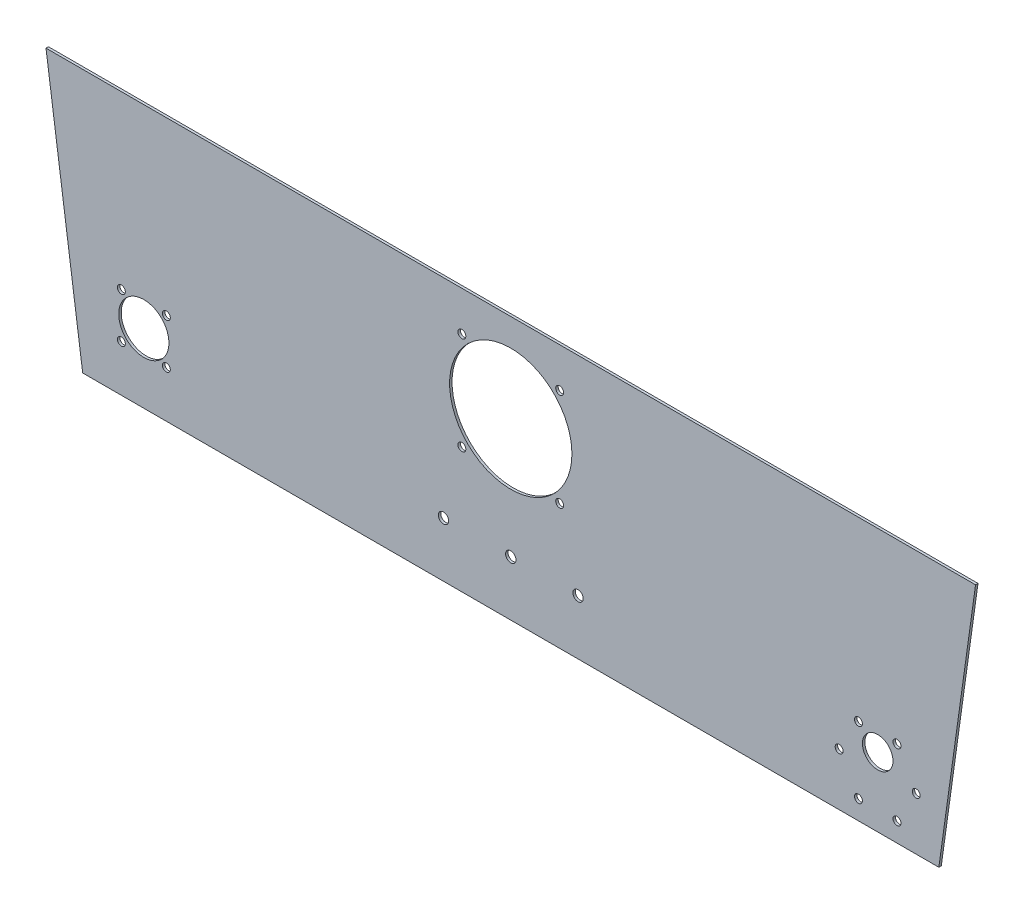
ISO-10303-21;
HEADER;
FILE_DESCRIPTION(('STEP AP214'),'2;1');
FILE_NAME('part.step','',(''),(''),'','','');
FILE_SCHEMA(('AUTOMOTIVE_DESIGN { 1 0 10303 214 1 1 1 1 }'));
ENDSEC;
DATA;
#1=APPLICATION_CONTEXT('core data for automotive mechanical design processes');
#2=APPLICATION_PROTOCOL_DEFINITION('international standard','automotive_design',2000,#1);
#3=PRODUCT_CONTEXT('',#1,'mechanical');
#4=PRODUCT('Part','Part','',(#3));
#5=PRODUCT_RELATED_PRODUCT_CATEGORY('part','',(#4));
#6=PRODUCT_DEFINITION_FORMATION('','',#4);
#7=PRODUCT_DEFINITION_CONTEXT('part definition',#1,'design');
#8=PRODUCT_DEFINITION('design','',#6,#7);
#9=PRODUCT_DEFINITION_SHAPE('','',#8);
#10=(LENGTH_UNIT() NAMED_UNIT(*) SI_UNIT(.MILLI.,.METRE.));
#11=(NAMED_UNIT(*) PLANE_ANGLE_UNIT() SI_UNIT($,.RADIAN.));
#12=(NAMED_UNIT(*) SI_UNIT($,.STERADIAN.) SOLID_ANGLE_UNIT());
#13=UNCERTAINTY_MEASURE_WITH_UNIT(LENGTH_MEASURE(1.E-05),#10,'distance_accuracy_value','');
#14=(GEOMETRIC_REPRESENTATION_CONTEXT(3) GLOBAL_UNCERTAINTY_ASSIGNED_CONTEXT((#13)) GLOBAL_UNIT_ASSIGNED_CONTEXT((#10,
#11,#12)) REPRESENTATION_CONTEXT('',''));
#15=CARTESIAN_POINT('',(0.,0.,0.));
#16=DIRECTION('',(0.,0.,1.));
#17=DIRECTION('',(1.,0.,0.));
#18=AXIS2_PLACEMENT_3D('',#15,#16,#17);
#19=CARTESIAN_POINT('',(0.,0.,1.));
#20=DIRECTION('',(0.,0.,1.));
#21=DIRECTION('',(1.,0.,0.));
#22=AXIS2_PLACEMENT_3D('',#19,#20,#21);
#23=PLANE('',#22);
#24=CARTESIAN_POINT('',(4.78484024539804,53.5438661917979,1.));
#25=DIRECTION('',(0.,0.,1.));
#26=DIRECTION('',(1.,0.,0.));
#27=AXIS2_PLACEMENT_3D('',#24,#25,#26);
#28=CIRCLE('',#27,1.625);
#29=CARTESIAN_POINT('',(6.40984024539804,53.5438661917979,1.));
#30=VERTEX_POINT('',#29);
#31=EDGE_CURVE('E589',#30,#30,#28,.T.);
#32=ORIENTED_EDGE('',*,*,#31,.F.);
#33=EDGE_LOOP('',(#32));
#34=FACE_BOUND('',#33,.T.);
#35=CARTESIAN_POINT('',(4.78484024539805,13.5438661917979,1.));
#36=DIRECTION('',(0.,0.,1.));
#37=DIRECTION('',(1.,0.,0.));
#38=AXIS2_PLACEMENT_3D('',#35,#36,#37);
#39=CIRCLE('',#38,1.625);
#40=CARTESIAN_POINT('',(6.40984024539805,13.5438661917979,1.));
#41=VERTEX_POINT('',#40);
#42=EDGE_CURVE('E590',#41,#41,#39,.T.);
#43=ORIENTED_EDGE('',*,*,#42,.F.);
#44=EDGE_LOOP('',(#43));
#45=FACE_BOUND('',#44,.T.);
#46=CARTESIAN_POINT('',(24.7848402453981,33.5438661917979,1.));
#47=DIRECTION('',(0.,0.,1.));
#48=DIRECTION('',(1.,0.,0.));
#49=AXIS2_PLACEMENT_3D('',#46,#47,#48);
#50=CIRCLE('',#49,25.);
#51=CARTESIAN_POINT('',(49.7848402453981,33.5438661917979,1.));
#52=VERTEX_POINT('',#51);
#53=EDGE_CURVE('E599',#52,#52,#50,.T.);
#54=ORIENTED_EDGE('',*,*,#53,.F.);
#55=EDGE_LOOP('',(#54));
#56=FACE_BOUND('',#55,.T.);
#57=CARTESIAN_POINT('',(44.7848402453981,13.5438661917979,1.));
#58=DIRECTION('',(0.,0.,1.));
#59=DIRECTION('',(1.,0.,0.));
#60=AXIS2_PLACEMENT_3D('',#57,#58,#59);
#61=CIRCLE('',#60,1.625);
#62=CARTESIAN_POINT('',(46.4098402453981,13.5438661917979,1.));
#63=VERTEX_POINT('',#62);
#64=EDGE_CURVE('E594',#63,#63,#61,.T.);
#65=ORIENTED_EDGE('',*,*,#64,.F.);
#66=EDGE_LOOP('',(#65));
#67=FACE_BOUND('',#66,.T.);
#68=CARTESIAN_POINT('',(44.7848402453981,53.5438661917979,1.));
#69=DIRECTION('',(0.,0.,1.));
#70=DIRECTION('',(1.,0.,0.));
#71=AXIS2_PLACEMENT_3D('',#68,#69,#70);
#72=CIRCLE('',#71,1.625);
#73=CARTESIAN_POINT('',(46.4098402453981,53.5438661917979,1.));
#74=VERTEX_POINT('',#73);
#75=EDGE_CURVE('E123',#74,#74,#72,.T.);
#76=ORIENTED_EDGE('',*,*,#75,.F.);
#77=EDGE_LOOP('',(#76));
#78=FACE_BOUND('',#77,.T.);
#79=CARTESIAN_POINT('',(-2.71793621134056,-15.3591030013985,1.));
#80=DIRECTION('',(0.,0.,1.));
#81=DIRECTION('',(1.,0.,0.));
#82=AXIS2_PLACEMENT_3D('',#79,#80,#81);
#83=CIRCLE('',#82,2.125);
#84=CARTESIAN_POINT('',(-0.59293621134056,-15.3591030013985,1.));
#85=VERTEX_POINT('',#84);
#86=EDGE_CURVE('E146',#85,#85,#83,.T.);
#87=ORIENTED_EDGE('',*,*,#86,.F.);
#88=EDGE_LOOP('',(#87));
#89=FACE_BOUND('',#88,.T.);
#90=CARTESIAN_POINT('',(-134.410324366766,-0.326714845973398,1.));
#91=DIRECTION('',(0.,0.,1.));
#92=DIRECTION('',(-1.,0.,0.));
#93=AXIS2_PLACEMENT_3D('',#90,#91,#92);
#94=CIRCLE('',#93,1.62499999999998);
#95=CARTESIAN_POINT('',(-136.035324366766,-0.326714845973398,1.));
#96=VERTEX_POINT('',#95);
#97=EDGE_CURVE('E158',#96,#96,#94,.T.);
#98=ORIENTED_EDGE('',*,*,#97,.F.);
#99=EDGE_LOOP('',(#98));
#100=FACE_BOUND('',#99,.T.);
#101=CARTESIAN_POINT('',(-134.410324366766,-18.7114911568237,1.));
#102=DIRECTION('',(0.,0.,1.));
#103=DIRECTION('',(1.,0.,0.));
#104=AXIS2_PLACEMENT_3D('',#101,#102,#103);
#105=CIRCLE('',#104,1.62499999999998);
#106=CARTESIAN_POINT('',(-132.785324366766,-18.7114911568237,1.));
#107=VERTEX_POINT('',#106);
#108=EDGE_CURVE('E170',#107,#107,#105,.T.);
#109=ORIENTED_EDGE('',*,*,#108,.F.);
#110=EDGE_LOOP('',(#109));
#111=FACE_BOUND('',#110,.T.);
#112=CARTESIAN_POINT('',(24.7820637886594,-15.3591030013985,1.));
#113=DIRECTION('',(0.,0.,1.));
#114=DIRECTION('',(1.,0.,0.));
#115=AXIS2_PLACEMENT_3D('',#112,#113,#114);
#116=CIRCLE('',#115,2.125);
#117=CARTESIAN_POINT('',(26.9070637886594,-15.3591030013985,1.));
#118=VERTEX_POINT('',#117);
#119=EDGE_CURVE('E182',#118,#118,#116,.T.);
#120=ORIENTED_EDGE('',*,*,#119,.F.);
#121=EDGE_LOOP('',(#120));
#122=FACE_BOUND('',#121,.T.);
#123=CARTESIAN_POINT('',(182.657063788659,-2.63172817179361,1.));
#124=DIRECTION('',(0.,0.,1.));
#125=DIRECTION('',(1.,0.,0.));
#126=AXIS2_PLACEMENT_3D('',#123,#124,#125);
#127=CIRCLE('',#126,1.62499999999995);
#128=CARTESIAN_POINT('',(184.282063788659,-2.63172817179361,1.));
#129=VERTEX_POINT('',#128);
#130=EDGE_CURVE('E194',#129,#129,#127,.T.);
#131=ORIENTED_EDGE('',*,*,#130,.F.);
#132=EDGE_LOOP('',(#131));
#133=FACE_BOUND('',#132,.T.);
#134=CARTESIAN_POINT('',(-116.025548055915,-0.326714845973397,1.));
#135=DIRECTION('',(0.,0.,1.));
#136=DIRECTION('',(1.,0.,0.));
#137=AXIS2_PLACEMENT_3D('',#134,#135,#136);
#138=CIRCLE('',#137,1.625);
#139=CARTESIAN_POINT('',(-114.400548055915,-0.326714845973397,1.));
#140=VERTEX_POINT('',#139);
#141=EDGE_CURVE('E206',#140,#140,#138,.T.);
#142=ORIENTED_EDGE('',*,*,#141,.F.);
#143=EDGE_LOOP('',(#142));
#144=FACE_BOUND('',#143,.T.);
#145=CARTESIAN_POINT('',(174.782063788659,-9.51910300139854,1.));
#146=DIRECTION('',(0.,0.,1.));
#147=DIRECTION('',(1.,0.,0.));
#148=AXIS2_PLACEMENT_3D('',#145,#146,#147);
#149=CIRCLE('',#148,6.25);
#150=CARTESIAN_POINT('',(181.032063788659,-9.51910300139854,1.));
#151=VERTEX_POINT('',#150);
#152=EDGE_CURVE('E218',#151,#151,#149,.T.);
#153=ORIENTED_EDGE('',*,*,#152,.F.);
#154=EDGE_LOOP('',(#153));
#155=FACE_BOUND('',#154,.T.);
#156=DIRECTION('',(0.138222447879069,0.990401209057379,0.));
#157=VECTOR('',#156,1.);
#158=CARTESIAN_POINT('',(199.782063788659,-37.7691030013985,1.));
#159=LINE('',#158,#157);
#160=CARTESIAN_POINT('',(199.782063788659,-37.7691030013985,1.));
#161=VERTEX_POINT('',#160);
#162=CARTESIAN_POINT('',(214.78624948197,69.7399440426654,1.));
#163=VERTEX_POINT('',#162);
#164=EDGE_CURVE('E97',#161,#163,#159,.T.);
#165=ORIENTED_EDGE('',*,*,#164,.T.);
#166=DIRECTION('',(-1.,0.,0.));
#167=VECTOR('',#166,1.);
#168=CARTESIAN_POINT('',(214.78624948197,69.7399440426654,1.));
#169=LINE('',#168,#167);
#170=CARTESIAN_POINT('',(-165.21375051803,69.7399440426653,1.));
#171=VERTEX_POINT('',#170);
#172=EDGE_CURVE('E92',#163,#171,#169,.T.);
#173=ORIENTED_EDGE('',*,*,#172,.T.);
#174=DIRECTION('',(0.138146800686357,-0.990411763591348,0.));
#175=VECTOR('',#174,1.);
#176=CARTESIAN_POINT('',(-165.21375051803,69.7399440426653,1.));
#177=LINE('',#176,#175);
#178=CARTESIAN_POINT('',(-150.217936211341,-37.7691030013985,1.));
#179=VERTEX_POINT('',#178);
#180=EDGE_CURVE('E95',#171,#179,#177,.T.);
#181=ORIENTED_EDGE('',*,*,#180,.T.);
#182=DIRECTION('',(1.,0.,0.));
#183=VECTOR('',#182,1.);
#184=CARTESIAN_POINT('',(-150.217936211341,-37.7691030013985,1.));
#185=LINE('',#184,#183);
#186=EDGE_CURVE('E62',#179,#161,#185,.T.);
#187=ORIENTED_EDGE('',*,*,#186,.T.);
#188=EDGE_LOOP('',(#165,#173,#181,#187));
#189=FACE_BOUND('',#188,.T.);
#190=CARTESIAN_POINT('',(-125.217936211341,-9.51910300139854,1.));
#191=DIRECTION('',(0.,0.,1.));
#192=DIRECTION('',(1.,0.,0.));
#193=AXIS2_PLACEMENT_3D('',#190,#191,#192);
#194=CIRCLE('',#193,10.25);
#195=CARTESIAN_POINT('',(-114.967936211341,-9.51910300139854,1.));
#196=VERTEX_POINT('',#195);
#197=EDGE_CURVE('E113',#196,#196,#194,.T.);
#198=ORIENTED_EDGE('',*,*,#197,.F.);
#199=EDGE_LOOP('',(#198));
#200=FACE_BOUND('',#199,.T.);
#201=CARTESIAN_POINT('',(159.032063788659,-16.2716282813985,1.));
#202=DIRECTION('',(0.,0.,1.));
#203=DIRECTION('',(1.,0.,0.));
#204=AXIS2_PLACEMENT_3D('',#201,#202,#203);
#205=CIRCLE('',#204,1.62499999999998);
#206=CARTESIAN_POINT('',(160.657063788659,-16.2716282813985,1.));
#207=VERTEX_POINT('',#206);
#208=EDGE_CURVE('E212',#207,#207,#205,.T.);
#209=ORIENTED_EDGE('',*,*,#208,.F.);
#210=EDGE_LOOP('',(#209));
#211=FACE_BOUND('',#210,.T.);
#212=CARTESIAN_POINT('',(166.907063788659,-2.63172817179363,1.));
#213=DIRECTION('',(0.,0.,1.));
#214=DIRECTION('',(1.,0.,0.));
#215=AXIS2_PLACEMENT_3D('',#212,#213,#214);
#216=CIRCLE('',#215,1.62499999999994);
#217=CARTESIAN_POINT('',(168.532063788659,-2.63172817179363,1.));
#218=VERTEX_POINT('',#217);
#219=EDGE_CURVE('E200',#218,#218,#216,.T.);
#220=ORIENTED_EDGE('',*,*,#219,.F.);
#221=EDGE_LOOP('',(#220));
#222=FACE_BOUND('',#221,.T.);
#223=CARTESIAN_POINT('',(190.532063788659,-16.2716282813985,1.));
#224=DIRECTION('',(0.,0.,1.));
#225=DIRECTION('',(1.,0.,0.));
#226=AXIS2_PLACEMENT_3D('',#223,#224,#225);
#227=CIRCLE('',#226,1.62499999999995);
#228=CARTESIAN_POINT('',(192.157063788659,-16.2716282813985,1.));
#229=VERTEX_POINT('',#228);
#230=EDGE_CURVE('E188',#229,#229,#227,.T.);
#231=ORIENTED_EDGE('',*,*,#230,.F.);
#232=EDGE_LOOP('',(#231));
#233=FACE_BOUND('',#232,.T.);
#234=CARTESIAN_POINT('',(182.657063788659,-29.9115283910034,1.));
#235=DIRECTION('',(0.,0.,1.));
#236=DIRECTION('',(1.,0.,0.));
#237=AXIS2_PLACEMENT_3D('',#234,#235,#236);
#238=CIRCLE('',#237,1.62499999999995);
#239=CARTESIAN_POINT('',(184.282063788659,-29.9115283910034,1.));
#240=VERTEX_POINT('',#239);
#241=EDGE_CURVE('E176',#240,#240,#238,.T.);
#242=ORIENTED_EDGE('',*,*,#241,.F.);
#243=EDGE_LOOP('',(#242));
#244=FACE_BOUND('',#243,.T.);
#245=CARTESIAN_POINT('',(-116.025548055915,-18.7114911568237,1.));
#246=DIRECTION('',(0.,0.,1.));
#247=DIRECTION('',(-1.,0.,0.));
#248=AXIS2_PLACEMENT_3D('',#245,#246,#247);
#249=CIRCLE('',#248,1.625);
#250=CARTESIAN_POINT('',(-117.650548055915,-18.7114911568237,1.));
#251=VERTEX_POINT('',#250);
#252=EDGE_CURVE('E164',#251,#251,#249,.T.);
#253=ORIENTED_EDGE('',*,*,#252,.F.);
#254=EDGE_LOOP('',(#253));
#255=FACE_BOUND('',#254,.T.);
#256=CARTESIAN_POINT('',(166.907063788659,-29.9115283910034,1.));
#257=DIRECTION('',(0.,0.,1.));
#258=DIRECTION('',(1.,0.,0.));
#259=AXIS2_PLACEMENT_3D('',#256,#257,#258);
#260=CIRCLE('',#259,1.62499999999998);
#261=CARTESIAN_POINT('',(168.532063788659,-29.9115283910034,1.));
#262=VERTEX_POINT('',#261);
#263=EDGE_CURVE('E152',#262,#262,#260,.T.);
#264=ORIENTED_EDGE('',*,*,#263,.F.);
#265=EDGE_LOOP('',(#264));
#266=FACE_BOUND('',#265,.T.);
#267=CARTESIAN_POINT('',(52.2820637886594,-15.3591030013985,1.));
#268=DIRECTION('',(0.,0.,1.));
#269=DIRECTION('',(1.,0.,0.));
#270=AXIS2_PLACEMENT_3D('',#267,#268,#269);
#271=CIRCLE('',#270,2.125);
#272=CARTESIAN_POINT('',(54.4070637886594,-15.3591030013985,1.));
#273=VERTEX_POINT('',#272);
#274=EDGE_CURVE('E137',#273,#273,#271,.T.);
#275=ORIENTED_EDGE('',*,*,#274,.F.);
#276=EDGE_LOOP('',(#275));
#277=FACE_BOUND('',#276,.T.);
#278=ADVANCED_FACE('F43',(#34,#45,#56,#67,#78,#89,#100,#111,#122,#133,#144,#155,#189,#200,#211,
#222,#233,#244,#255,#266,#277),#23,.T.);
#279=CARTESIAN_POINT('',(0.,0.,0.));
#280=DIRECTION('',(0.,0.,1.));
#281=DIRECTION('',(1.,0.,0.));
#282=AXIS2_PLACEMENT_3D('',#279,#280,#281);
#283=PLANE('',#282);
#284=CARTESIAN_POINT('',(4.78484024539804,53.5438661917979,0.));
#285=DIRECTION('',(0.,0.,1.));
#286=DIRECTION('',(1.,0.,0.));
#287=AXIS2_PLACEMENT_3D('',#284,#285,#286);
#288=CIRCLE('',#287,1.625);
#289=CARTESIAN_POINT('',(6.40984024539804,53.5438661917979,0.));
#290=VERTEX_POINT('',#289);
#291=EDGE_CURVE('E47',#290,#290,#288,.T.);
#292=ORIENTED_EDGE('',*,*,#291,.T.);
#293=EDGE_LOOP('',(#292));
#294=FACE_BOUND('',#293,.T.);
#295=CARTESIAN_POINT('',(4.78484024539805,13.5438661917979,0.));
#296=DIRECTION('',(0.,0.,1.));
#297=DIRECTION('',(1.,0.,0.));
#298=AXIS2_PLACEMENT_3D('',#295,#296,#297);
#299=CIRCLE('',#298,1.625);
#300=CARTESIAN_POINT('',(6.40984024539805,13.5438661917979,0.));
#301=VERTEX_POINT('',#300);
#302=EDGE_CURVE('E128',#301,#301,#299,.T.);
#303=ORIENTED_EDGE('',*,*,#302,.T.);
#304=EDGE_LOOP('',(#303));
#305=FACE_BOUND('',#304,.T.);
#306=CARTESIAN_POINT('',(24.7848402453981,33.5438661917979,0.));
#307=DIRECTION('',(0.,0.,1.));
#308=DIRECTION('',(1.,0.,0.));
#309=AXIS2_PLACEMENT_3D('',#306,#307,#308);
#310=CIRCLE('',#309,25.);
#311=CARTESIAN_POINT('',(49.7848402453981,33.5438661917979,0.));
#312=VERTEX_POINT('',#311);
#313=EDGE_CURVE('E126',#312,#312,#310,.T.);
#314=ORIENTED_EDGE('',*,*,#313,.T.);
#315=EDGE_LOOP('',(#314));
#316=FACE_BOUND('',#315,.T.);
#317=CARTESIAN_POINT('',(44.7848402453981,13.5438661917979,0.));
#318=DIRECTION('',(0.,0.,1.));
#319=DIRECTION('',(1.,0.,0.));
#320=AXIS2_PLACEMENT_3D('',#317,#318,#319);
#321=CIRCLE('',#320,1.625);
#322=CARTESIAN_POINT('',(46.4098402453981,13.5438661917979,0.));
#323=VERTEX_POINT('',#322);
#324=EDGE_CURVE('E122',#323,#323,#321,.T.);
#325=ORIENTED_EDGE('',*,*,#324,.T.);
#326=EDGE_LOOP('',(#325));
#327=FACE_BOUND('',#326,.T.);
#328=CARTESIAN_POINT('',(44.7848402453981,53.5438661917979,0.));
#329=DIRECTION('',(0.,0.,1.));
#330=DIRECTION('',(1.,0.,0.));
#331=AXIS2_PLACEMENT_3D('',#328,#329,#330);
#332=CIRCLE('',#331,1.625);
#333=CARTESIAN_POINT('',(46.4098402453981,53.5438661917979,0.));
#334=VERTEX_POINT('',#333);
#335=EDGE_CURVE('E119',#334,#334,#332,.T.);
#336=ORIENTED_EDGE('',*,*,#335,.T.);
#337=EDGE_LOOP('',(#336));
#338=FACE_BOUND('',#337,.T.);
#339=DIRECTION('',(0.138222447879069,0.990401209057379,0.));
#340=VECTOR('',#339,1.);
#341=CARTESIAN_POINT('',(199.782063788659,-37.7691030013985,0.));
#342=LINE('',#341,#340);
#343=CARTESIAN_POINT('',(199.782063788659,-37.7691030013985,0.));
#344=VERTEX_POINT('',#343);
#345=CARTESIAN_POINT('',(214.78624948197,69.7399440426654,0.));
#346=VERTEX_POINT('',#345);
#347=EDGE_CURVE('E110',#344,#346,#342,.T.);
#348=ORIENTED_EDGE('',*,*,#347,.F.);
#349=DIRECTION('',(1.,0.,0.));
#350=VECTOR('',#349,1.);
#351=CARTESIAN_POINT('',(-150.217936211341,-37.7691030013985,0.));
#352=LINE('',#351,#350);
#353=CARTESIAN_POINT('',(-150.217936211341,-37.7691030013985,0.));
#354=VERTEX_POINT('',#353);
#355=EDGE_CURVE('E85',#354,#344,#352,.T.);
#356=ORIENTED_EDGE('',*,*,#355,.F.);
#357=DIRECTION('',(0.138146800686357,-0.990411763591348,0.));
#358=VECTOR('',#357,1.);
#359=CARTESIAN_POINT('',(-165.21375051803,69.7399440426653,0.));
#360=LINE('',#359,#358);
#361=CARTESIAN_POINT('',(-165.21375051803,69.7399440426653,0.));
#362=VERTEX_POINT('',#361);
#363=EDGE_CURVE('E79',#362,#354,#360,.T.);
#364=ORIENTED_EDGE('',*,*,#363,.F.);
#365=DIRECTION('',(-1.,0.,0.));
#366=VECTOR('',#365,1.);
#367=CARTESIAN_POINT('',(214.78624948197,69.7399440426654,0.));
#368=LINE('',#367,#366);
#369=EDGE_CURVE('E101',#346,#362,#368,.T.);
#370=ORIENTED_EDGE('',*,*,#369,.F.);
#371=EDGE_LOOP('',(#348,#356,#364,#370));
#372=FACE_BOUND('',#371,.T.);
#373=CARTESIAN_POINT('',(-125.217936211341,-9.51910300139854,0.));
#374=DIRECTION('',(0.,0.,1.));
#375=DIRECTION('',(1.,0.,0.));
#376=AXIS2_PLACEMENT_3D('',#373,#374,#375);
#377=CIRCLE('',#376,10.25);
#378=CARTESIAN_POINT('',(-114.967936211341,-9.51910300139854,0.));
#379=VERTEX_POINT('',#378);
#380=EDGE_CURVE('E221',#379,#379,#377,.T.);
#381=ORIENTED_EDGE('',*,*,#380,.T.);
#382=EDGE_LOOP('',(#381));
#383=FACE_BOUND('',#382,.T.);
#384=CARTESIAN_POINT('',(174.782063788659,-9.51910300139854,0.));
#385=DIRECTION('',(0.,0.,1.));
#386=DIRECTION('',(1.,0.,0.));
#387=AXIS2_PLACEMENT_3D('',#384,#385,#386);
#388=CIRCLE('',#387,6.25);
#389=CARTESIAN_POINT('',(181.032063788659,-9.51910300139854,0.));
#390=VERTEX_POINT('',#389);
#391=EDGE_CURVE('E215',#390,#390,#388,.T.);
#392=ORIENTED_EDGE('',*,*,#391,.T.);
#393=EDGE_LOOP('',(#392));
#394=FACE_BOUND('',#393,.T.);
#395=CARTESIAN_POINT('',(159.032063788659,-16.2716282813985,0.));
#396=DIRECTION('',(0.,0.,1.));
#397=DIRECTION('',(1.,0.,0.));
#398=AXIS2_PLACEMENT_3D('',#395,#396,#397);
#399=CIRCLE('',#398,1.62499999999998);
#400=CARTESIAN_POINT('',(160.657063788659,-16.2716282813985,0.));
#401=VERTEX_POINT('',#400);
#402=EDGE_CURVE('E209',#401,#401,#399,.T.);
#403=ORIENTED_EDGE('',*,*,#402,.T.);
#404=EDGE_LOOP('',(#403));
#405=FACE_BOUND('',#404,.T.);
#406=CARTESIAN_POINT('',(-116.025548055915,-0.326714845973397,0.));
#407=DIRECTION('',(0.,0.,1.));
#408=DIRECTION('',(1.,0.,0.));
#409=AXIS2_PLACEMENT_3D('',#406,#407,#408);
#410=CIRCLE('',#409,1.625);
#411=CARTESIAN_POINT('',(-114.400548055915,-0.326714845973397,0.));
#412=VERTEX_POINT('',#411);
#413=EDGE_CURVE('E203',#412,#412,#410,.T.);
#414=ORIENTED_EDGE('',*,*,#413,.T.);
#415=EDGE_LOOP('',(#414));
#416=FACE_BOUND('',#415,.T.);
#417=CARTESIAN_POINT('',(166.907063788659,-2.63172817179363,0.));
#418=DIRECTION('',(0.,0.,1.));
#419=DIRECTION('',(1.,0.,0.));
#420=AXIS2_PLACEMENT_3D('',#417,#418,#419);
#421=CIRCLE('',#420,1.62499999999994);
#422=CARTESIAN_POINT('',(168.532063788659,-2.63172817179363,0.));
#423=VERTEX_POINT('',#422);
#424=EDGE_CURVE('E197',#423,#423,#421,.T.);
#425=ORIENTED_EDGE('',*,*,#424,.T.);
#426=EDGE_LOOP('',(#425));
#427=FACE_BOUND('',#426,.T.);
#428=CARTESIAN_POINT('',(182.657063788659,-2.63172817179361,0.));
#429=DIRECTION('',(0.,0.,1.));
#430=DIRECTION('',(1.,0.,0.));
#431=AXIS2_PLACEMENT_3D('',#428,#429,#430);
#432=CIRCLE('',#431,1.62499999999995);
#433=CARTESIAN_POINT('',(184.282063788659,-2.63172817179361,0.));
#434=VERTEX_POINT('',#433);
#435=EDGE_CURVE('E191',#434,#434,#432,.T.);
#436=ORIENTED_EDGE('',*,*,#435,.T.);
#437=EDGE_LOOP('',(#436));
#438=FACE_BOUND('',#437,.T.);
#439=CARTESIAN_POINT('',(190.532063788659,-16.2716282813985,0.));
#440=DIRECTION('',(0.,0.,1.));
#441=DIRECTION('',(1.,0.,0.));
#442=AXIS2_PLACEMENT_3D('',#439,#440,#441);
#443=CIRCLE('',#442,1.62499999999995);
#444=CARTESIAN_POINT('',(192.157063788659,-16.2716282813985,0.));
#445=VERTEX_POINT('',#444);
#446=EDGE_CURVE('E185',#445,#445,#443,.T.);
#447=ORIENTED_EDGE('',*,*,#446,.T.);
#448=EDGE_LOOP('',(#447));
#449=FACE_BOUND('',#448,.T.);
#450=CARTESIAN_POINT('',(24.7820637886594,-15.3591030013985,0.));
#451=DIRECTION('',(0.,0.,1.));
#452=DIRECTION('',(1.,0.,0.));
#453=AXIS2_PLACEMENT_3D('',#450,#451,#452);
#454=CIRCLE('',#453,2.125);
#455=CARTESIAN_POINT('',(26.9070637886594,-15.3591030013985,0.));
#456=VERTEX_POINT('',#455);
#457=EDGE_CURVE('E179',#456,#456,#454,.T.);
#458=ORIENTED_EDGE('',*,*,#457,.T.);
#459=EDGE_LOOP('',(#458));
#460=FACE_BOUND('',#459,.T.);
#461=CARTESIAN_POINT('',(182.657063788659,-29.9115283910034,0.));
#462=DIRECTION('',(0.,0.,1.));
#463=DIRECTION('',(1.,0.,0.));
#464=AXIS2_PLACEMENT_3D('',#461,#462,#463);
#465=CIRCLE('',#464,1.62499999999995);
#466=CARTESIAN_POINT('',(184.282063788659,-29.9115283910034,0.));
#467=VERTEX_POINT('',#466);
#468=EDGE_CURVE('E173',#467,#467,#465,.T.);
#469=ORIENTED_EDGE('',*,*,#468,.T.);
#470=EDGE_LOOP('',(#469));
#471=FACE_BOUND('',#470,.T.);
#472=CARTESIAN_POINT('',(-134.410324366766,-18.7114911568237,0.));
#473=DIRECTION('',(0.,0.,1.));
#474=DIRECTION('',(1.,0.,0.));
#475=AXIS2_PLACEMENT_3D('',#472,#473,#474);
#476=CIRCLE('',#475,1.62499999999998);
#477=CARTESIAN_POINT('',(-132.785324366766,-18.7114911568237,0.));
#478=VERTEX_POINT('',#477);
#479=EDGE_CURVE('E167',#478,#478,#476,.T.);
#480=ORIENTED_EDGE('',*,*,#479,.T.);
#481=EDGE_LOOP('',(#480));
#482=FACE_BOUND('',#481,.T.);
#483=CARTESIAN_POINT('',(-116.025548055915,-18.7114911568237,0.));
#484=DIRECTION('',(0.,0.,1.));
#485=DIRECTION('',(-1.,0.,0.));
#486=AXIS2_PLACEMENT_3D('',#483,#484,#485);
#487=CIRCLE('',#486,1.625);
#488=CARTESIAN_POINT('',(-117.650548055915,-18.7114911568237,0.));
#489=VERTEX_POINT('',#488);
#490=EDGE_CURVE('E161',#489,#489,#487,.T.);
#491=ORIENTED_EDGE('',*,*,#490,.T.);
#492=EDGE_LOOP('',(#491));
#493=FACE_BOUND('',#492,.T.);
#494=CARTESIAN_POINT('',(-134.410324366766,-0.326714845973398,0.));
#495=DIRECTION('',(0.,0.,1.));
#496=DIRECTION('',(-1.,0.,0.));
#497=AXIS2_PLACEMENT_3D('',#494,#495,#496);
#498=CIRCLE('',#497,1.62499999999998);
#499=CARTESIAN_POINT('',(-136.035324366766,-0.326714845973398,0.));
#500=VERTEX_POINT('',#499);
#501=EDGE_CURVE('E155',#500,#500,#498,.T.);
#502=ORIENTED_EDGE('',*,*,#501,.T.);
#503=EDGE_LOOP('',(#502));
#504=FACE_BOUND('',#503,.T.);
#505=CARTESIAN_POINT('',(166.907063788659,-29.9115283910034,0.));
#506=DIRECTION('',(0.,0.,1.));
#507=DIRECTION('',(1.,0.,0.));
#508=AXIS2_PLACEMENT_3D('',#505,#506,#507);
#509=CIRCLE('',#508,1.62499999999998);
#510=CARTESIAN_POINT('',(168.532063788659,-29.9115283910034,0.));
#511=VERTEX_POINT('',#510);
#512=EDGE_CURVE('E149',#511,#511,#509,.T.);
#513=ORIENTED_EDGE('',*,*,#512,.T.);
#514=EDGE_LOOP('',(#513));
#515=FACE_BOUND('',#514,.T.);
#516=CARTESIAN_POINT('',(-2.71793621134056,-15.3591030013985,0.));
#517=DIRECTION('',(0.,0.,1.));
#518=DIRECTION('',(1.,0.,0.));
#519=AXIS2_PLACEMENT_3D('',#516,#517,#518);
#520=CIRCLE('',#519,2.125);
#521=CARTESIAN_POINT('',(-0.59293621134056,-15.3591030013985,0.));
#522=VERTEX_POINT('',#521);
#523=EDGE_CURVE('E142',#522,#522,#520,.T.);
#524=ORIENTED_EDGE('',*,*,#523,.T.);
#525=EDGE_LOOP('',(#524));
#526=FACE_BOUND('',#525,.T.);
#527=CARTESIAN_POINT('',(52.2820637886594,-15.3591030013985,0.));
#528=DIRECTION('',(0.,0.,1.));
#529=DIRECTION('',(1.,0.,0.));
#530=AXIS2_PLACEMENT_3D('',#527,#528,#529);
#531=CIRCLE('',#530,2.125);
#532=CARTESIAN_POINT('',(54.4070637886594,-15.3591030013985,0.));
#533=VERTEX_POINT('',#532);
#534=EDGE_CURVE('E133',#533,#533,#531,.T.);
#535=ORIENTED_EDGE('',*,*,#534,.T.);
#536=EDGE_LOOP('',(#535));
#537=FACE_BOUND('',#536,.T.);
#538=ADVANCED_FACE('F229',(#294,#305,#316,#327,#338,#372,#383,#394,#405,#416,#427,#438,#449,
#460,#471,#482,#493,#504,#515,#526,#537),#283,.F.);
#539=CARTESIAN_POINT('',(199.782063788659,-37.7691030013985,1.));
#540=DIRECTION('',(-0.990401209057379,0.138222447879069,0.));
#541=DIRECTION('',(-0.138222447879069,-0.990401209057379,0.));
#542=AXIS2_PLACEMENT_3D('',#539,#540,#541);
#543=PLANE('',#542);
#544=ORIENTED_EDGE('',*,*,#347,.T.);
#545=DIRECTION('',(0.,0.,-1.));
#546=VECTOR('',#545,1.);
#547=CARTESIAN_POINT('',(214.78624948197,69.7399440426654,1.));
#548=LINE('',#547,#546);
#549=EDGE_CURVE('E11',#163,#346,#548,.T.);
#550=ORIENTED_EDGE('',*,*,#549,.F.);
#551=ORIENTED_EDGE('',*,*,#164,.F.);
#552=DIRECTION('',(0.,0.,-1.));
#553=VECTOR('',#552,1.);
#554=CARTESIAN_POINT('',(199.782063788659,-37.7691030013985,1.));
#555=LINE('',#554,#553);
#556=EDGE_CURVE('E106',#161,#344,#555,.T.);
#557=ORIENTED_EDGE('',*,*,#556,.T.);
#558=EDGE_LOOP('',(#544,#550,#551,#557));
#559=FACE_BOUND('',#558,.T.);
#560=ADVANCED_FACE('F45',(#559),#543,.F.);
#561=CARTESIAN_POINT('',(214.78624948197,69.7399440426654,1.));
#562=DIRECTION('',(0.,-1.,0.));
#563=DIRECTION('',(1.,0.,0.));
#564=AXIS2_PLACEMENT_3D('',#561,#562,#563);
#565=PLANE('',#564);
#566=ORIENTED_EDGE('',*,*,#369,.T.);
#567=DIRECTION('',(0.,0.,-1.));
#568=VECTOR('',#567,1.);
#569=CARTESIAN_POINT('',(-165.21375051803,69.7399440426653,1.));
#570=LINE('',#569,#568);
#571=EDGE_CURVE('E53',#171,#362,#570,.T.);
#572=ORIENTED_EDGE('',*,*,#571,.F.);
#573=ORIENTED_EDGE('',*,*,#172,.F.);
#574=ORIENTED_EDGE('',*,*,#549,.T.);
#575=EDGE_LOOP('',(#566,#572,#573,#574));
#576=FACE_BOUND('',#575,.T.);
#577=ADVANCED_FACE('F100',(#576),#565,.F.);
#578=CARTESIAN_POINT('',(-165.21375051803,69.7399440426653,1.));
#579=DIRECTION('',(0.990411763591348,0.138146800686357,0.));
#580=DIRECTION('',(-0.138146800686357,0.990411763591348,0.));
#581=AXIS2_PLACEMENT_3D('',#578,#579,#580);
#582=PLANE('',#581);
#583=ORIENTED_EDGE('',*,*,#363,.T.);
#584=DIRECTION('',(0.,0.,-1.));
#585=VECTOR('',#584,1.);
#586=CARTESIAN_POINT('',(-150.217936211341,-37.7691030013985,1.));
#587=LINE('',#586,#585);
#588=EDGE_CURVE('E102',#179,#354,#587,.T.);
#589=ORIENTED_EDGE('',*,*,#588,.F.);
#590=ORIENTED_EDGE('',*,*,#180,.F.);
#591=ORIENTED_EDGE('',*,*,#571,.T.);
#592=EDGE_LOOP('',(#583,#589,#590,#591));
#593=FACE_BOUND('',#592,.T.);
#594=ADVANCED_FACE('F104',(#593),#582,.F.);
#595=CARTESIAN_POINT('',(-150.217936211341,-37.7691030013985,1.));
#596=DIRECTION('',(0.,1.,0.));
#597=DIRECTION('',(0.,0.,1.));
#598=AXIS2_PLACEMENT_3D('',#595,#596,#597);
#599=PLANE('',#598);
#600=ORIENTED_EDGE('',*,*,#355,.T.);
#601=ORIENTED_EDGE('',*,*,#556,.F.);
#602=ORIENTED_EDGE('',*,*,#186,.F.);
#603=ORIENTED_EDGE('',*,*,#588,.T.);
#604=EDGE_LOOP('',(#600,#601,#602,#603));
#605=FACE_BOUND('',#604,.T.);
#606=ADVANCED_FACE('F235',(#605),#599,.F.);
#607=CARTESIAN_POINT('',(-125.217936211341,-9.51910300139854,1.));
#608=DIRECTION('',(0.,0.,-1.));
#609=DIRECTION('',(-1.,0.,0.));
#610=AXIS2_PLACEMENT_3D('',#607,#608,#609);
#611=CYLINDRICAL_SURFACE('',#610,10.25);
#612=ORIENTED_EDGE('',*,*,#197,.T.);
#613=EDGE_LOOP('',(#612));
#614=FACE_BOUND('',#613,.T.);
#615=ORIENTED_EDGE('',*,*,#380,.F.);
#616=EDGE_LOOP('',(#615));
#617=FACE_BOUND('',#616,.T.);
#618=ADVANCED_FACE('F232',(#614,#617),#611,.F.);
#619=CARTESIAN_POINT('',(174.782063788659,-9.51910300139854,1.));
#620=DIRECTION('',(0.,0.,-1.));
#621=DIRECTION('',(-1.,0.,0.));
#622=AXIS2_PLACEMENT_3D('',#619,#620,#621);
#623=CYLINDRICAL_SURFACE('',#622,6.25);
#624=ORIENTED_EDGE('',*,*,#152,.T.);
#625=EDGE_LOOP('',(#624));
#626=FACE_BOUND('',#625,.T.);
#627=ORIENTED_EDGE('',*,*,#391,.F.);
#628=EDGE_LOOP('',(#627));
#629=FACE_BOUND('',#628,.T.);
#630=ADVANCED_FACE('F234',(#626,#629),#623,.F.);
#631=CARTESIAN_POINT('',(159.032063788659,-16.2716282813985,1.));
#632=DIRECTION('',(0.,0.,-1.));
#633=DIRECTION('',(-1.,0.,0.));
#634=AXIS2_PLACEMENT_3D('',#631,#632,#633);
#635=CYLINDRICAL_SURFACE('',#634,1.62499999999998);
#636=ORIENTED_EDGE('',*,*,#208,.T.);
#637=EDGE_LOOP('',(#636));
#638=FACE_BOUND('',#637,.T.);
#639=ORIENTED_EDGE('',*,*,#402,.F.);
#640=EDGE_LOOP('',(#639));
#641=FACE_BOUND('',#640,.T.);
#642=ADVANCED_FACE('F242',(#638,#641),#635,.F.);
#643=CARTESIAN_POINT('',(-116.025548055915,-0.326714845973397,1.));
#644=DIRECTION('',(0.,0.,-1.));
#645=DIRECTION('',(-1.,0.,0.));
#646=AXIS2_PLACEMENT_3D('',#643,#644,#645);
#647=CYLINDRICAL_SURFACE('',#646,1.625);
#648=ORIENTED_EDGE('',*,*,#141,.T.);
#649=EDGE_LOOP('',(#648));
#650=FACE_BOUND('',#649,.T.);
#651=ORIENTED_EDGE('',*,*,#413,.F.);
#652=EDGE_LOOP('',(#651));
#653=FACE_BOUND('',#652,.T.);
#654=ADVANCED_FACE('F412',(#650,#653),#647,.F.);
#655=CARTESIAN_POINT('',(166.907063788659,-2.63172817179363,1.));
#656=DIRECTION('',(0.,0.,-1.));
#657=DIRECTION('',(-1.,0.,0.));
#658=AXIS2_PLACEMENT_3D('',#655,#656,#657);
#659=CYLINDRICAL_SURFACE('',#658,1.62499999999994);
#660=ORIENTED_EDGE('',*,*,#219,.T.);
#661=EDGE_LOOP('',(#660));
#662=FACE_BOUND('',#661,.T.);
#663=ORIENTED_EDGE('',*,*,#424,.F.);
#664=EDGE_LOOP('',(#663));
#665=FACE_BOUND('',#664,.T.);
#666=ADVANCED_FACE('F400',(#662,#665),#659,.F.);
#667=CARTESIAN_POINT('',(182.657063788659,-2.63172817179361,1.));
#668=DIRECTION('',(0.,0.,-1.));
#669=DIRECTION('',(-1.,0.,0.));
#670=AXIS2_PLACEMENT_3D('',#667,#668,#669);
#671=CYLINDRICAL_SURFACE('',#670,1.62499999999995);
#672=ORIENTED_EDGE('',*,*,#130,.T.);
#673=EDGE_LOOP('',(#672));
#674=FACE_BOUND('',#673,.T.);
#675=ORIENTED_EDGE('',*,*,#435,.F.);
#676=EDGE_LOOP('',(#675));
#677=FACE_BOUND('',#676,.T.);
#678=ADVANCED_FACE('F388',(#674,#677),#671,.F.);
#679=CARTESIAN_POINT('',(190.532063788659,-16.2716282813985,1.));
#680=DIRECTION('',(0.,0.,-1.));
#681=DIRECTION('',(-1.,0.,0.));
#682=AXIS2_PLACEMENT_3D('',#679,#680,#681);
#683=CYLINDRICAL_SURFACE('',#682,1.62499999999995);
#684=ORIENTED_EDGE('',*,*,#230,.T.);
#685=EDGE_LOOP('',(#684));
#686=FACE_BOUND('',#685,.T.);
#687=ORIENTED_EDGE('',*,*,#446,.F.);
#688=EDGE_LOOP('',(#687));
#689=FACE_BOUND('',#688,.T.);
#690=ADVANCED_FACE('F376',(#686,#689),#683,.F.);
#691=CARTESIAN_POINT('',(24.7820637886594,-15.3591030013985,1.));
#692=DIRECTION('',(0.,0.,-1.));
#693=DIRECTION('',(-1.,0.,0.));
#694=AXIS2_PLACEMENT_3D('',#691,#692,#693);
#695=CYLINDRICAL_SURFACE('',#694,2.125);
#696=ORIENTED_EDGE('',*,*,#119,.T.);
#697=EDGE_LOOP('',(#696));
#698=FACE_BOUND('',#697,.T.);
#699=ORIENTED_EDGE('',*,*,#457,.F.);
#700=EDGE_LOOP('',(#699));
#701=FACE_BOUND('',#700,.T.);
#702=ADVANCED_FACE('F364',(#698,#701),#695,.F.);
#703=CARTESIAN_POINT('',(182.657063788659,-29.9115283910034,1.));
#704=DIRECTION('',(0.,0.,-1.));
#705=DIRECTION('',(-1.,0.,0.));
#706=AXIS2_PLACEMENT_3D('',#703,#704,#705);
#707=CYLINDRICAL_SURFACE('',#706,1.62499999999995);
#708=ORIENTED_EDGE('',*,*,#241,.T.);
#709=EDGE_LOOP('',(#708));
#710=FACE_BOUND('',#709,.T.);
#711=ORIENTED_EDGE('',*,*,#468,.F.);
#712=EDGE_LOOP('',(#711));
#713=FACE_BOUND('',#712,.T.);
#714=ADVANCED_FACE('F352',(#710,#713),#707,.F.);
#715=CARTESIAN_POINT('',(-134.410324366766,-18.7114911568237,1.));
#716=DIRECTION('',(0.,0.,-1.));
#717=DIRECTION('',(-1.,0.,0.));
#718=AXIS2_PLACEMENT_3D('',#715,#716,#717);
#719=CYLINDRICAL_SURFACE('',#718,1.62499999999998);
#720=ORIENTED_EDGE('',*,*,#108,.T.);
#721=EDGE_LOOP('',(#720));
#722=FACE_BOUND('',#721,.T.);
#723=ORIENTED_EDGE('',*,*,#479,.F.);
#724=EDGE_LOOP('',(#723));
#725=FACE_BOUND('',#724,.T.);
#726=ADVANCED_FACE('F340',(#722,#725),#719,.F.);
#727=CARTESIAN_POINT('',(-116.025548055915,-18.7114911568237,1.));
#728=DIRECTION('',(0.,0.,-1.));
#729=DIRECTION('',(-1.,0.,0.));
#730=AXIS2_PLACEMENT_3D('',#727,#728,#729);
#731=CYLINDRICAL_SURFACE('',#730,1.625);
#732=ORIENTED_EDGE('',*,*,#252,.T.);
#733=EDGE_LOOP('',(#732));
#734=FACE_BOUND('',#733,.T.);
#735=ORIENTED_EDGE('',*,*,#490,.F.);
#736=EDGE_LOOP('',(#735));
#737=FACE_BOUND('',#736,.T.);
#738=ADVANCED_FACE('F328',(#734,#737),#731,.F.);
#739=CARTESIAN_POINT('',(-134.410324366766,-0.326714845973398,1.));
#740=DIRECTION('',(0.,0.,-1.));
#741=DIRECTION('',(-1.,0.,0.));
#742=AXIS2_PLACEMENT_3D('',#739,#740,#741);
#743=CYLINDRICAL_SURFACE('',#742,1.62499999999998);
#744=ORIENTED_EDGE('',*,*,#97,.T.);
#745=EDGE_LOOP('',(#744));
#746=FACE_BOUND('',#745,.T.);
#747=ORIENTED_EDGE('',*,*,#501,.F.);
#748=EDGE_LOOP('',(#747));
#749=FACE_BOUND('',#748,.T.);
#750=ADVANCED_FACE('F316',(#746,#749),#743,.F.);
#751=CARTESIAN_POINT('',(166.907063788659,-29.9115283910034,1.));
#752=DIRECTION('',(0.,0.,-1.));
#753=DIRECTION('',(-1.,0.,0.));
#754=AXIS2_PLACEMENT_3D('',#751,#752,#753);
#755=CYLINDRICAL_SURFACE('',#754,1.62499999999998);
#756=ORIENTED_EDGE('',*,*,#263,.T.);
#757=EDGE_LOOP('',(#756));
#758=FACE_BOUND('',#757,.T.);
#759=ORIENTED_EDGE('',*,*,#512,.F.);
#760=EDGE_LOOP('',(#759));
#761=FACE_BOUND('',#760,.T.);
#762=ADVANCED_FACE('F304',(#758,#761),#755,.F.);
#763=CARTESIAN_POINT('',(-2.71793621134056,-15.3591030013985,1.));
#764=DIRECTION('',(0.,0.,-1.));
#765=DIRECTION('',(-1.,0.,0.));
#766=AXIS2_PLACEMENT_3D('',#763,#764,#765);
#767=CYLINDRICAL_SURFACE('',#766,2.125);
#768=ORIENTED_EDGE('',*,*,#86,.T.);
#769=EDGE_LOOP('',(#768));
#770=FACE_BOUND('',#769,.T.);
#771=ORIENTED_EDGE('',*,*,#523,.F.);
#772=EDGE_LOOP('',(#771));
#773=FACE_BOUND('',#772,.T.);
#774=ADVANCED_FACE('F290',(#770,#773),#767,.F.);
#775=CARTESIAN_POINT('',(52.2820637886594,-15.3591030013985,1.));
#776=DIRECTION('',(0.,0.,-1.));
#777=DIRECTION('',(-1.,0.,0.));
#778=AXIS2_PLACEMENT_3D('',#775,#776,#777);
#779=CYLINDRICAL_SURFACE('',#778,2.125);
#780=ORIENTED_EDGE('',*,*,#274,.T.);
#781=EDGE_LOOP('',(#780));
#782=FACE_BOUND('',#781,.T.);
#783=ORIENTED_EDGE('',*,*,#534,.F.);
#784=EDGE_LOOP('',(#783));
#785=FACE_BOUND('',#784,.T.);
#786=ADVANCED_FACE('F283',(#782,#785),#779,.F.);
#787=CARTESIAN_POINT('',(44.7848402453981,53.5438661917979,-9.));
#788=DIRECTION('',(0.,0.,1.));
#789=DIRECTION('',(1.,0.,0.));
#790=AXIS2_PLACEMENT_3D('',#787,#788,#789);
#791=CYLINDRICAL_SURFACE('',#790,1.625);
#792=ORIENTED_EDGE('',*,*,#75,.T.);
#793=EDGE_LOOP('',(#792));
#794=FACE_BOUND('',#793,.T.);
#795=ORIENTED_EDGE('',*,*,#335,.F.);
#796=EDGE_LOOP('',(#795));
#797=FACE_BOUND('',#796,.T.);
#798=ADVANCED_FACE('F289',(#794,#797),#791,.F.);
#799=CARTESIAN_POINT('',(44.7848402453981,13.5438661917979,-9.));
#800=DIRECTION('',(0.,0.,1.));
#801=DIRECTION('',(1.,0.,0.));
#802=AXIS2_PLACEMENT_3D('',#799,#800,#801);
#803=CYLINDRICAL_SURFACE('',#802,1.625);
#804=ORIENTED_EDGE('',*,*,#64,.T.);
#805=EDGE_LOOP('',(#804));
#806=FACE_BOUND('',#805,.T.);
#807=ORIENTED_EDGE('',*,*,#324,.F.);
#808=EDGE_LOOP('',(#807));
#809=FACE_BOUND('',#808,.T.);
#810=ADVANCED_FACE('F511',(#806,#809),#803,.F.);
#811=CARTESIAN_POINT('',(24.7848402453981,33.5438661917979,-9.));
#812=DIRECTION('',(0.,0.,1.));
#813=DIRECTION('',(1.,0.,0.));
#814=AXIS2_PLACEMENT_3D('',#811,#812,#813);
#815=CYLINDRICAL_SURFACE('',#814,25.);
#816=ORIENTED_EDGE('',*,*,#53,.T.);
#817=EDGE_LOOP('',(#816));
#818=FACE_BOUND('',#817,.T.);
#819=ORIENTED_EDGE('',*,*,#313,.F.);
#820=EDGE_LOOP('',(#819));
#821=FACE_BOUND('',#820,.T.);
#822=ADVANCED_FACE('F520',(#818,#821),#815,.F.);
#823=CARTESIAN_POINT('',(4.78484024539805,13.5438661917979,-9.));
#824=DIRECTION('',(0.,0.,1.));
#825=DIRECTION('',(1.,0.,0.));
#826=AXIS2_PLACEMENT_3D('',#823,#824,#825);
#827=CYLINDRICAL_SURFACE('',#826,1.625);
#828=ORIENTED_EDGE('',*,*,#42,.T.);
#829=EDGE_LOOP('',(#828));
#830=FACE_BOUND('',#829,.T.);
#831=ORIENTED_EDGE('',*,*,#302,.F.);
#832=EDGE_LOOP('',(#831));
#833=FACE_BOUND('',#832,.T.);
#834=ADVANCED_FACE('F530',(#830,#833),#827,.F.);
#835=CARTESIAN_POINT('',(4.78484024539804,53.5438661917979,-9.));
#836=DIRECTION('',(0.,0.,1.));
#837=DIRECTION('',(1.,0.,0.));
#838=AXIS2_PLACEMENT_3D('',#835,#836,#837);
#839=CYLINDRICAL_SURFACE('',#838,1.625);
#840=ORIENTED_EDGE('',*,*,#31,.T.);
#841=EDGE_LOOP('',(#840));
#842=FACE_BOUND('',#841,.T.);
#843=ORIENTED_EDGE('',*,*,#291,.F.);
#844=EDGE_LOOP('',(#843));
#845=FACE_BOUND('',#844,.T.);
#846=ADVANCED_FACE('F540',(#842,#845),#839,.F.);
#847=CLOSED_SHELL('',(#278,#538,#560,#577,#594,#606,#618,#630,#642,#654,#666,#678,#690,#702,
#714,#726,#738,#750,#762,#774,#786,#798,#810,#822,#834,#846));
#848=MANIFOLD_SOLID_BREP('B2',#847);
#849=ADVANCED_BREP_SHAPE_REPRESENTATION('',(#18,#848),#14);
#850=SHAPE_DEFINITION_REPRESENTATION(#9,#849);
ENDSEC;
END-ISO-10303-21;
